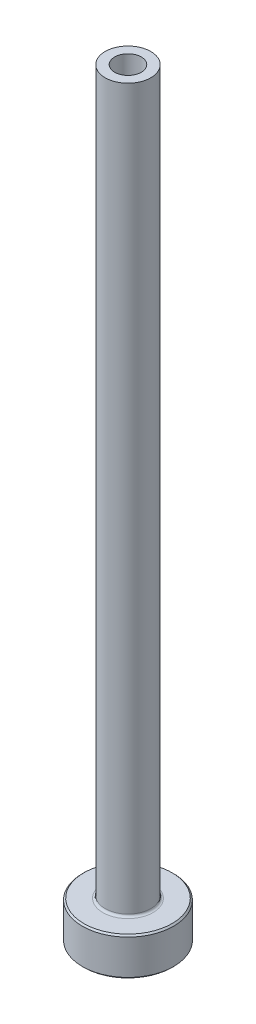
ISO-10303-21;
HEADER;
FILE_DESCRIPTION(('STEP AP214'),'2;1');
FILE_NAME('part.step','',(''),(''),'','','');
FILE_SCHEMA(('AUTOMOTIVE_DESIGN { 1 0 10303 214 1 1 1 1 }'));
ENDSEC;
DATA;
#1=APPLICATION_CONTEXT('core data for automotive mechanical design processes');
#2=APPLICATION_PROTOCOL_DEFINITION('international standard','automotive_design',2000,#1);
#3=PRODUCT_CONTEXT('',#1,'mechanical');
#4=PRODUCT('Part','Part','',(#3));
#5=PRODUCT_RELATED_PRODUCT_CATEGORY('part','',(#4));
#6=PRODUCT_DEFINITION_FORMATION('','',#4);
#7=PRODUCT_DEFINITION_CONTEXT('part definition',#1,'design');
#8=PRODUCT_DEFINITION('design','',#6,#7);
#9=PRODUCT_DEFINITION_SHAPE('','',#8);
#10=(LENGTH_UNIT() NAMED_UNIT(*) SI_UNIT(.MILLI.,.METRE.));
#11=(NAMED_UNIT(*) PLANE_ANGLE_UNIT() SI_UNIT($,.RADIAN.));
#12=(NAMED_UNIT(*) SI_UNIT($,.STERADIAN.) SOLID_ANGLE_UNIT());
#13=UNCERTAINTY_MEASURE_WITH_UNIT(LENGTH_MEASURE(1.E-05),#10,'distance_accuracy_value','');
#14=(GEOMETRIC_REPRESENTATION_CONTEXT(3) GLOBAL_UNCERTAINTY_ASSIGNED_CONTEXT((#13)) GLOBAL_UNIT_ASSIGNED_CONTEXT((#10,
#11,#12)) REPRESENTATION_CONTEXT('',''));
#15=CARTESIAN_POINT('',(0.,0.,0.));
#16=DIRECTION('',(0.,0.,1.));
#17=DIRECTION('',(1.,0.,0.));
#18=AXIS2_PLACEMENT_3D('',#15,#16,#17);
#19=CARTESIAN_POINT('',(0.,92.1876809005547,0.));
#20=DIRECTION('',(0.,1.,0.));
#21=DIRECTION('',(0.,0.,1.));
#22=AXIS2_PLACEMENT_3D('',#19,#20,#21);
#23=CYLINDRICAL_SURFACE('',#22,1.74999999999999);
#24=CARTESIAN_POINT('',(0.,100.,0.));
#25=DIRECTION('',(0.,1.,0.));
#26=DIRECTION('',(0.,0.,1.));
#27=AXIS2_PLACEMENT_3D('',#24,#25,#26);
#28=CIRCLE('',#27,1.74999999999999);
#29=CARTESIAN_POINT('',(0.,100.,1.74999999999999));
#30=VERTEX_POINT('',#29);
#31=EDGE_CURVE('E62',#30,#30,#28,.T.);
#32=ORIENTED_EDGE('',*,*,#31,.T.);
#33=EDGE_LOOP('',(#32));
#34=FACE_BOUND('',#33,.T.);
#35=CARTESIAN_POINT('',(0.,55.,0.));
#36=DIRECTION('',(0.,1.,0.));
#37=DIRECTION('',(0.,0.,1.));
#38=AXIS2_PLACEMENT_3D('',#35,#36,#37);
#39=CIRCLE('',#38,1.74999999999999);
#40=CARTESIAN_POINT('',(0.,55.,1.74999999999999));
#41=VERTEX_POINT('',#40);
#42=EDGE_CURVE('E71',#41,#41,#39,.T.);
#43=ORIENTED_EDGE('',*,*,#42,.F.);
#44=EDGE_LOOP('',(#43));
#45=FACE_BOUND('',#44,.T.);
#46=ADVANCED_FACE('F30',(#34,#45),#23,.F.);
#47=CARTESIAN_POINT('',(-1.74999999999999,100.,0.));
#48=DIRECTION('',(0.,1.,0.));
#49=DIRECTION('',(0.,0.,1.));
#50=AXIS2_PLACEMENT_3D('',#47,#48,#49);
#51=PLANE('',#50);
#52=CARTESIAN_POINT('',(0.,100.,0.));
#53=DIRECTION('',(0.,1.,0.));
#54=DIRECTION('',(0.,0.,1.));
#55=AXIS2_PLACEMENT_3D('',#52,#53,#54);
#56=CIRCLE('',#55,3.);
#57=CARTESIAN_POINT('',(0.,100.,3.));
#58=VERTEX_POINT('',#57);
#59=EDGE_CURVE('E65',#58,#58,#56,.T.);
#60=ORIENTED_EDGE('',*,*,#59,.T.);
#61=EDGE_LOOP('',(#60));
#62=FACE_BOUND('',#61,.T.);
#63=ORIENTED_EDGE('',*,*,#31,.F.);
#64=EDGE_LOOP('',(#63));
#65=FACE_BOUND('',#64,.T.);
#66=ADVANCED_FACE('F79',(#62,#65),#51,.T.);
#67=CARTESIAN_POINT('',(0.,92.1876809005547,0.));
#68=DIRECTION('',(0.,1.,0.));
#69=DIRECTION('',(0.,0.,1.));
#70=AXIS2_PLACEMENT_3D('',#67,#68,#69);
#71=CYLINDRICAL_SURFACE('',#70,2.99999999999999);
#72=CARTESIAN_POINT('',(0.,5.3,0.));
#73=DIRECTION('',(0.,1.,0.));
#74=DIRECTION('',(0.,0.,1.));
#75=AXIS2_PLACEMENT_3D('',#72,#73,#74);
#76=CIRCLE('',#75,2.99999999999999);
#77=CARTESIAN_POINT('',(0.,5.3,2.99999999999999));
#78=VERTEX_POINT('',#77);
#79=EDGE_CURVE('E59',#78,#78,#76,.T.);
#80=ORIENTED_EDGE('',*,*,#79,.T.);
#81=EDGE_LOOP('',(#80));
#82=FACE_BOUND('',#81,.T.);
#83=ORIENTED_EDGE('',*,*,#59,.F.);
#84=EDGE_LOOP('',(#83));
#85=FACE_BOUND('',#84,.T.);
#86=ADVANCED_FACE('F85',(#82,#85),#71,.T.);
#87=CARTESIAN_POINT('',(-2.99999999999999,5.,0.));
#88=DIRECTION('',(0.,1.,0.));
#89=DIRECTION('',(0.,0.,1.));
#90=AXIS2_PLACEMENT_3D('',#87,#88,#89);
#91=PLANE('',#90);
#92=CARTESIAN_POINT('',(0.,5.,0.));
#93=DIRECTION('',(0.,1.,0.));
#94=DIRECTION('',(0.,0.,1.));
#95=AXIS2_PLACEMENT_3D('',#92,#93,#94);
#96=CIRCLE('',#95,5.79999999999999);
#97=CARTESIAN_POINT('',(0.,5.,5.79999999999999));
#98=VERTEX_POINT('',#97);
#99=EDGE_CURVE('E53',#98,#98,#96,.T.);
#100=ORIENTED_EDGE('',*,*,#99,.T.);
#101=EDGE_LOOP('',(#100));
#102=FACE_BOUND('',#101,.T.);
#103=CARTESIAN_POINT('',(0.,5.,0.));
#104=DIRECTION('',(0.,1.,0.));
#105=DIRECTION('',(0.,0.,1.));
#106=AXIS2_PLACEMENT_3D('',#103,#104,#105);
#107=CIRCLE('',#106,3.29999999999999);
#108=CARTESIAN_POINT('',(0.,5.,3.29999999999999));
#109=VERTEX_POINT('',#108);
#110=EDGE_CURVE('E56',#109,#109,#107,.F.);
#111=ORIENTED_EDGE('',*,*,#110,.T.);
#112=EDGE_LOOP('',(#111));
#113=FACE_BOUND('',#112,.T.);
#114=ADVANCED_FACE('F111',(#102,#113),#91,.T.);
#115=CARTESIAN_POINT('',(0.,92.1876809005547,0.));
#116=DIRECTION('',(0.,1.,0.));
#117=DIRECTION('',(0.,0.,1.));
#118=AXIS2_PLACEMENT_3D('',#115,#116,#117);
#119=CYLINDRICAL_SURFACE('',#118,5.99999999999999);
#120=CARTESIAN_POINT('',(0.,4.79999999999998,0.));
#121=DIRECTION('',(0.,1.,0.));
#122=DIRECTION('',(0.,0.,1.));
#123=AXIS2_PLACEMENT_3D('',#120,#121,#122);
#124=CIRCLE('',#123,5.99999999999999);
#125=CARTESIAN_POINT('',(0.,4.79999999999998,5.99999999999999));
#126=VERTEX_POINT('',#125);
#127=EDGE_CURVE('E45',#126,#126,#124,.F.);
#128=ORIENTED_EDGE('',*,*,#127,.T.);
#129=EDGE_LOOP('',(#128));
#130=FACE_BOUND('',#129,.T.);
#131=CARTESIAN_POINT('',(0.,0.200000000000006,0.));
#132=DIRECTION('',(0.,-1.,0.));
#133=DIRECTION('',(0.,0.,-1.));
#134=AXIS2_PLACEMENT_3D('',#131,#132,#133);
#135=CIRCLE('',#134,5.99999999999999);
#136=CARTESIAN_POINT('',(0.,0.200000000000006,-5.99999999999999));
#137=VERTEX_POINT('',#136);
#138=EDGE_CURVE('E50',#137,#137,#135,.F.);
#139=ORIENTED_EDGE('',*,*,#138,.T.);
#140=EDGE_LOOP('',(#139));
#141=FACE_BOUND('',#140,.T.);
#142=ADVANCED_FACE('F108',(#130,#141),#119,.T.);
#143=CARTESIAN_POINT('',(-5.99999999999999,0.,0.));
#144=DIRECTION('',(0.,-1.,0.));
#145=DIRECTION('',(0.,0.,-1.));
#146=AXIS2_PLACEMENT_3D('',#143,#144,#145);
#147=PLANE('',#146);
#148=CARTESIAN_POINT('',(0.,0.,0.));
#149=DIRECTION('',(0.,-1.,0.));
#150=DIRECTION('',(0.,0.,-1.));
#151=AXIS2_PLACEMENT_3D('',#148,#149,#150);
#152=CIRCLE('',#151,2.49999999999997);
#153=CARTESIAN_POINT('',(0.,0.,-2.49999999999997));
#154=VERTEX_POINT('',#153);
#155=EDGE_CURVE('E37',#154,#154,#152,.F.);
#156=ORIENTED_EDGE('',*,*,#155,.T.);
#157=EDGE_LOOP('',(#156));
#158=FACE_BOUND('',#157,.T.);
#159=CARTESIAN_POINT('',(0.,0.,0.));
#160=DIRECTION('',(0.,-1.,0.));
#161=DIRECTION('',(0.,0.,-1.));
#162=AXIS2_PLACEMENT_3D('',#159,#160,#161);
#163=CIRCLE('',#162,5.79999999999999);
#164=CARTESIAN_POINT('',(0.,0.,-5.79999999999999));
#165=VERTEX_POINT('',#164);
#166=EDGE_CURVE('E41',#165,#165,#163,.T.);
#167=ORIENTED_EDGE('',*,*,#166,.T.);
#168=EDGE_LOOP('',(#167));
#169=FACE_BOUND('',#168,.T.);
#170=ADVANCED_FACE('F110',(#158,#169),#147,.T.);
#171=CARTESIAN_POINT('',(0.,92.1876809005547,0.));
#172=DIRECTION('',(0.,1.,0.));
#173=DIRECTION('',(0.,0.,1.));
#174=AXIS2_PLACEMENT_3D('',#171,#172,#173);
#175=CYLINDRICAL_SURFACE('',#174,1.99999999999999);
#176=CARTESIAN_POINT('',(0.,0.499999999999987,0.));
#177=DIRECTION('',(0.,-1.,0.));
#178=DIRECTION('',(0.,0.,-1.));
#179=AXIS2_PLACEMENT_3D('',#176,#177,#178);
#180=CIRCLE('',#179,1.99999999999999);
#181=CARTESIAN_POINT('',(0.,0.499999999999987,-1.99999999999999));
#182=VERTEX_POINT('',#181);
#183=EDGE_CURVE('E10',#182,#182,#180,.T.);
#184=ORIENTED_EDGE('',*,*,#183,.T.);
#185=EDGE_LOOP('',(#184));
#186=FACE_BOUND('',#185,.T.);
#187=CARTESIAN_POINT('',(0.,43.,0.));
#188=DIRECTION('',(0.,1.,0.));
#189=DIRECTION('',(0.,0.,1.));
#190=AXIS2_PLACEMENT_3D('',#187,#188,#189);
#191=CIRCLE('',#190,2.);
#192=CARTESIAN_POINT('',(0.,43.,2.));
#193=VERTEX_POINT('',#192);
#194=EDGE_CURVE('E68',#193,#193,#191,.T.);
#195=ORIENTED_EDGE('',*,*,#194,.T.);
#196=EDGE_LOOP('',(#195));
#197=FACE_BOUND('',#196,.T.);
#198=ADVANCED_FACE('F118',(#186,#197),#175,.F.);
#199=CARTESIAN_POINT('',(0.,43.,0.));
#200=DIRECTION('',(0.,-1.,0.));
#201=DIRECTION('',(0.,0.,-1.));
#202=AXIS2_PLACEMENT_3D('',#199,#200,#201);
#203=CONICAL_SURFACE('',#202,2.,0.0208303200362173);
#204=ORIENTED_EDGE('',*,*,#42,.T.);
#205=EDGE_LOOP('',(#204));
#206=FACE_BOUND('',#205,.T.);
#207=ORIENTED_EDGE('',*,*,#194,.F.);
#208=EDGE_LOOP('',(#207));
#209=FACE_BOUND('',#208,.T.);
#210=ADVANCED_FACE('F75',(#206,#209),#203,.F.);
#211=CARTESIAN_POINT('',(0.,5.3,0.));
#212=DIRECTION('',(0.,1.,0.));
#213=DIRECTION('',(0.,0.,1.));
#214=AXIS2_PLACEMENT_3D('',#211,#212,#213);
#215=TOROIDAL_SURFACE('',#214,3.29999999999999,0.3);
#216=ORIENTED_EDGE('',*,*,#110,.F.);
#217=EDGE_LOOP('',(#216));
#218=FACE_BOUND('',#217,.T.);
#219=ORIENTED_EDGE('',*,*,#79,.F.);
#220=EDGE_LOOP('',(#219));
#221=FACE_BOUND('',#220,.T.);
#222=ADVANCED_FACE('F90',(#218,#221),#215,.F.);
#223=CARTESIAN_POINT('',(0.,5.,0.));
#224=DIRECTION('',(0.,-1.,0.));
#225=DIRECTION('',(0.,0.,-1.));
#226=AXIS2_PLACEMENT_3D('',#223,#224,#225);
#227=CONICAL_SURFACE('',#226,5.79999999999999,0.785398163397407);
#228=ORIENTED_EDGE('',*,*,#127,.F.);
#229=EDGE_LOOP('',(#228));
#230=FACE_BOUND('',#229,.T.);
#231=ORIENTED_EDGE('',*,*,#99,.F.);
#232=EDGE_LOOP('',(#231));
#233=FACE_BOUND('',#232,.T.);
#234=ADVANCED_FACE('F93',(#230,#233),#227,.T.);
#235=CARTESIAN_POINT('',(0.,0.200000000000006,0.));
#236=DIRECTION('',(0.,1.,0.));
#237=DIRECTION('',(0.,0.,1.));
#238=AXIS2_PLACEMENT_3D('',#235,#236,#237);
#239=CONICAL_SURFACE('',#238,5.99999999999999,0.78539816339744);
#240=ORIENTED_EDGE('',*,*,#166,.F.);
#241=EDGE_LOOP('',(#240));
#242=FACE_BOUND('',#241,.T.);
#243=ORIENTED_EDGE('',*,*,#138,.F.);
#244=EDGE_LOOP('',(#243));
#245=FACE_BOUND('',#244,.T.);
#246=ADVANCED_FACE('F96',(#242,#245),#239,.T.);
#247=CARTESIAN_POINT('',(0.,0.,0.));
#248=DIRECTION('',(0.,-1.,0.));
#249=DIRECTION('',(0.,0.,-1.));
#250=AXIS2_PLACEMENT_3D('',#247,#248,#249);
#251=CONICAL_SURFACE('',#250,2.49999999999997,0.785398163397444);
#252=ORIENTED_EDGE('',*,*,#183,.F.);
#253=EDGE_LOOP('',(#252));
#254=FACE_BOUND('',#253,.T.);
#255=ORIENTED_EDGE('',*,*,#155,.F.);
#256=EDGE_LOOP('',(#255));
#257=FACE_BOUND('',#256,.T.);
#258=ADVANCED_FACE('F32',(#254,#257),#251,.F.);
#259=CLOSED_SHELL('',(#46,#66,#86,#114,#142,#170,#198,#210,#222,#234,#246,#258));
#260=MANIFOLD_SOLID_BREP('B2',#259);
#261=ADVANCED_BREP_SHAPE_REPRESENTATION('',(#18,#260),#14);
#262=SHAPE_DEFINITION_REPRESENTATION(#9,#261);
ENDSEC;
END-ISO-10303-21;
